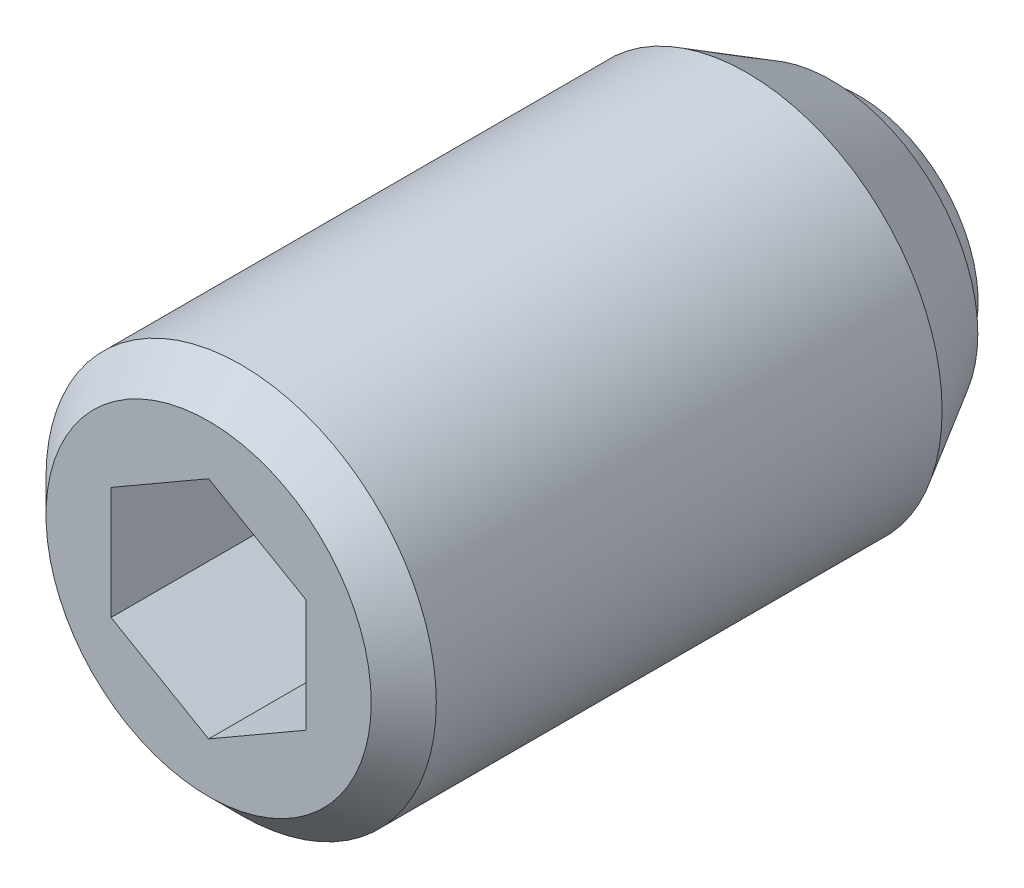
ISO-10303-21;
HEADER;
FILE_DESCRIPTION(('STEP AP214'),'2;1');
FILE_NAME('part.step','',(''),(''),'','','');
FILE_SCHEMA(('AUTOMOTIVE_DESIGN { 1 0 10303 214 1 1 1 1 }'));
ENDSEC;
DATA;
#1=APPLICATION_CONTEXT('core data for automotive mechanical design processes');
#2=APPLICATION_PROTOCOL_DEFINITION('international standard','automotive_design',2000,#1);
#3=PRODUCT_CONTEXT('',#1,'mechanical');
#4=PRODUCT('Part','Part','',(#3));
#5=PRODUCT_RELATED_PRODUCT_CATEGORY('part','',(#4));
#6=PRODUCT_DEFINITION_FORMATION('','',#4);
#7=PRODUCT_DEFINITION_CONTEXT('part definition',#1,'design');
#8=PRODUCT_DEFINITION('design','',#6,#7);
#9=PRODUCT_DEFINITION_SHAPE('','',#8);
#10=(LENGTH_UNIT() NAMED_UNIT(*) SI_UNIT(.MILLI.,.METRE.));
#11=(NAMED_UNIT(*) PLANE_ANGLE_UNIT() SI_UNIT($,.RADIAN.));
#12=(NAMED_UNIT(*) SI_UNIT($,.STERADIAN.) SOLID_ANGLE_UNIT());
#13=UNCERTAINTY_MEASURE_WITH_UNIT(LENGTH_MEASURE(1.E-05),#10,'distance_accuracy_value','');
#14=(GEOMETRIC_REPRESENTATION_CONTEXT(3) GLOBAL_UNCERTAINTY_ASSIGNED_CONTEXT((#13)) GLOBAL_UNIT_ASSIGNED_CONTEXT((#10,
#11,#12)) REPRESENTATION_CONTEXT('',''));
#15=CARTESIAN_POINT('',(0.,0.,0.));
#16=DIRECTION('',(0.,0.,1.));
#17=DIRECTION('',(1.,0.,0.));
#18=AXIS2_PLACEMENT_3D('',#15,#16,#17);
#19=CARTESIAN_POINT('',(3.,1.73205080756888,17.5));
#20=DIRECTION('',(0.5,0.86602540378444,0.));
#21=DIRECTION('',(0.86602540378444,-0.5,0.));
#22=AXIS2_PLACEMENT_3D('',#19,#20,#21);
#23=PLANE('',#22);
#24=DIRECTION('',(0.,0.,1.));
#25=VECTOR('',#24,1.);
#26=CARTESIAN_POINT('',(3.,1.73205080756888,17.5));
#27=LINE('',#26,#25);
#28=CARTESIAN_POINT('',(3.,1.73205080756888,15.));
#29=VERTEX_POINT('',#28);
#30=CARTESIAN_POINT('',(3.,1.73205080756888,20.));
#31=VERTEX_POINT('',#30);
#32=EDGE_CURVE('E68',#29,#31,#27,.T.);
#33=ORIENTED_EDGE('',*,*,#32,.T.);
#34=DIRECTION('',(-0.86602540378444,0.5,0.));
#35=VECTOR('',#34,1.);
#36=CARTESIAN_POINT('',(3.,1.73205080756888,20.));
#37=LINE('',#36,#35);
#38=CARTESIAN_POINT('',(0.,3.46410161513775,20.));
#39=VERTEX_POINT('',#38);
#40=EDGE_CURVE('E29',#31,#39,#37,.T.);
#41=ORIENTED_EDGE('',*,*,#40,.T.);
#42=DIRECTION('',(0.,0.,1.));
#43=VECTOR('',#42,1.);
#44=CARTESIAN_POINT('',(0.,3.46410161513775,17.5));
#45=LINE('',#44,#43);
#46=CARTESIAN_POINT('',(0.,3.46410161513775,15.));
#47=VERTEX_POINT('',#46);
#48=EDGE_CURVE('E80',#47,#39,#45,.T.);
#49=ORIENTED_EDGE('',*,*,#48,.F.);
#50=DIRECTION('',(-0.86602540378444,0.5,0.));
#51=VECTOR('',#50,1.);
#52=CARTESIAN_POINT('',(3.,1.73205080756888,15.));
#53=LINE('',#52,#51);
#54=EDGE_CURVE('E79',#29,#47,#53,.T.);
#55=ORIENTED_EDGE('',*,*,#54,.F.);
#56=EDGE_LOOP('',(#33,#41,#49,#55));
#57=FACE_BOUND('',#56,.T.);
#58=ADVANCED_FACE('F14',(#57),#23,.F.);
#59=CARTESIAN_POINT('',(3.,-1.73205080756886,17.5));
#60=DIRECTION('',(1.,0.,0.));
#61=DIRECTION('',(0.,-1.,0.));
#62=AXIS2_PLACEMENT_3D('',#59,#60,#61);
#63=PLANE('',#62);
#64=DIRECTION('',(0.,0.,1.));
#65=VECTOR('',#64,1.);
#66=CARTESIAN_POINT('',(3.,-1.73205080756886,17.5));
#67=LINE('',#66,#65);
#68=CARTESIAN_POINT('',(3.,-1.73205080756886,15.));
#69=VERTEX_POINT('',#68);
#70=CARTESIAN_POINT('',(3.,-1.73205080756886,20.));
#71=VERTEX_POINT('',#70);
#72=EDGE_CURVE('E76',#69,#71,#67,.T.);
#73=ORIENTED_EDGE('',*,*,#72,.T.);
#74=DIRECTION('',(0.,1.,0.));
#75=VECTOR('',#74,1.);
#76=CARTESIAN_POINT('',(3.,-1.73205080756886,20.));
#77=LINE('',#76,#75);
#78=EDGE_CURVE('E75',#71,#31,#77,.T.);
#79=ORIENTED_EDGE('',*,*,#78,.T.);
#80=ORIENTED_EDGE('',*,*,#32,.F.);
#81=DIRECTION('',(0.,1.,0.));
#82=VECTOR('',#81,1.);
#83=CARTESIAN_POINT('',(3.,-1.73205080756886,15.));
#84=LINE('',#83,#82);
#85=EDGE_CURVE('E72',#69,#29,#84,.T.);
#86=ORIENTED_EDGE('',*,*,#85,.F.);
#87=EDGE_LOOP('',(#73,#79,#80,#86));
#88=FACE_BOUND('',#87,.T.);
#89=ADVANCED_FACE('F70',(#88),#63,.F.);
#90=CARTESIAN_POINT('',(3.,-1.73205080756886,17.5));
#91=DIRECTION('',(-0.5,0.866025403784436,0.));
#92=DIRECTION('',(0.866025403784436,0.5,0.));
#93=AXIS2_PLACEMENT_3D('',#90,#91,#92);
#94=PLANE('',#93);
#95=DIRECTION('',(0.,0.,1.));
#96=VECTOR('',#95,1.);
#97=CARTESIAN_POINT('',(0.,-3.46410161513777,17.5));
#98=LINE('',#97,#96);
#99=CARTESIAN_POINT('',(0.,-3.46410161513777,15.));
#100=VERTEX_POINT('',#99);
#101=CARTESIAN_POINT('',(0.,-3.46410161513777,20.));
#102=VERTEX_POINT('',#101);
#103=EDGE_CURVE('E122',#100,#102,#98,.T.);
#104=ORIENTED_EDGE('',*,*,#103,.T.);
#105=DIRECTION('',(-0.866025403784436,-0.5,0.));
#106=VECTOR('',#105,1.);
#107=CARTESIAN_POINT('',(3.,-1.73205080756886,20.));
#108=LINE('',#107,#106);
#109=EDGE_CURVE('E113',#71,#102,#108,.T.);
#110=ORIENTED_EDGE('',*,*,#109,.F.);
#111=ORIENTED_EDGE('',*,*,#72,.F.);
#112=DIRECTION('',(0.866025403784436,0.5,0.));
#113=VECTOR('',#112,1.);
#114=CARTESIAN_POINT('',(0.,-3.46410161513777,15.));
#115=LINE('',#114,#113);
#116=EDGE_CURVE('E89',#100,#69,#115,.T.);
#117=ORIENTED_EDGE('',*,*,#116,.F.);
#118=EDGE_LOOP('',(#104,#110,#111,#117));
#119=FACE_BOUND('',#118,.T.);
#120=ADVANCED_FACE('F147',(#119),#94,.T.);
#121=CARTESIAN_POINT('',(-3.,-1.73205080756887,17.5));
#122=DIRECTION('',(-0.5,-0.866025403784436,0.));
#123=DIRECTION('',(-0.866025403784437,0.5,0.));
#124=AXIS2_PLACEMENT_3D('',#121,#122,#123);
#125=PLANE('',#124);
#126=DIRECTION('',(0.,0.,1.));
#127=VECTOR('',#126,1.);
#128=CARTESIAN_POINT('',(-3.,-1.73205080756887,17.5));
#129=LINE('',#128,#127);
#130=CARTESIAN_POINT('',(-3.,-1.73205080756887,15.));
#131=VERTEX_POINT('',#130);
#132=CARTESIAN_POINT('',(-3.,-1.73205080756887,20.));
#133=VERTEX_POINT('',#132);
#134=EDGE_CURVE('E120',#131,#133,#129,.T.);
#135=ORIENTED_EDGE('',*,*,#134,.T.);
#136=DIRECTION('',(0.866025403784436,-0.5,0.));
#137=VECTOR('',#136,1.);
#138=CARTESIAN_POINT('',(-3.,-1.73205080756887,20.));
#139=LINE('',#138,#137);
#140=EDGE_CURVE('E111',#133,#102,#139,.T.);
#141=ORIENTED_EDGE('',*,*,#140,.T.);
#142=ORIENTED_EDGE('',*,*,#103,.F.);
#143=DIRECTION('',(0.866025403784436,-0.5,0.));
#144=VECTOR('',#143,1.);
#145=CARTESIAN_POINT('',(-3.,-1.73205080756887,15.));
#146=LINE('',#145,#144);
#147=EDGE_CURVE('E101',#131,#100,#146,.T.);
#148=ORIENTED_EDGE('',*,*,#147,.F.);
#149=EDGE_LOOP('',(#135,#141,#142,#148));
#150=FACE_BOUND('',#149,.T.);
#151=ADVANCED_FACE('F157',(#150),#125,.F.);
#152=CARTESIAN_POINT('',(-3.,-1.73205080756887,17.5));
#153=DIRECTION('',(1.,0.,0.));
#154=DIRECTION('',(0.,-1.,0.));
#155=AXIS2_PLACEMENT_3D('',#152,#153,#154);
#156=PLANE('',#155);
#157=DIRECTION('',(0.,0.,1.));
#158=VECTOR('',#157,1.);
#159=CARTESIAN_POINT('',(-3.,1.73205080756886,17.5));
#160=LINE('',#159,#158);
#161=CARTESIAN_POINT('',(-3.,1.73205080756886,15.));
#162=VERTEX_POINT('',#161);
#163=CARTESIAN_POINT('',(-3.,1.73205080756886,20.));
#164=VERTEX_POINT('',#163);
#165=EDGE_CURVE('E37',#162,#164,#160,.T.);
#166=ORIENTED_EDGE('',*,*,#165,.T.);
#167=DIRECTION('',(0.,1.,0.));
#168=VECTOR('',#167,1.);
#169=CARTESIAN_POINT('',(-3.,-1.73205080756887,20.));
#170=LINE('',#169,#168);
#171=EDGE_CURVE('E108',#133,#164,#170,.T.);
#172=ORIENTED_EDGE('',*,*,#171,.F.);
#173=ORIENTED_EDGE('',*,*,#134,.F.);
#174=DIRECTION('',(0.,-1.,0.));
#175=VECTOR('',#174,1.);
#176=CARTESIAN_POINT('',(-3.,1.73205080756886,15.));
#177=LINE('',#176,#175);
#178=EDGE_CURVE('E98',#162,#131,#177,.T.);
#179=ORIENTED_EDGE('',*,*,#178,.F.);
#180=EDGE_LOOP('',(#166,#172,#173,#179));
#181=FACE_BOUND('',#180,.T.);
#182=ADVANCED_FACE('F153',(#181),#156,.T.);
#183=CARTESIAN_POINT('',(-3.,1.73205080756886,17.5));
#184=DIRECTION('',(0.5,-0.866025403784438,0.));
#185=DIRECTION('',(-0.866025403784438,-0.5,0.));
#186=AXIS2_PLACEMENT_3D('',#183,#184,#185);
#187=PLANE('',#186);
#188=ORIENTED_EDGE('',*,*,#165,.F.);
#189=DIRECTION('',(-0.866025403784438,-0.5,0.));
#190=VECTOR('',#189,1.);
#191=CARTESIAN_POINT('',(0.,3.46410161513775,15.));
#192=LINE('',#191,#190);
#193=EDGE_CURVE('E84',#47,#162,#192,.T.);
#194=ORIENTED_EDGE('',*,*,#193,.F.);
#195=ORIENTED_EDGE('',*,*,#48,.T.);
#196=DIRECTION('',(0.866025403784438,0.5,0.));
#197=VECTOR('',#196,1.);
#198=CARTESIAN_POINT('',(-3.,1.73205080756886,20.));
#199=LINE('',#198,#197);
#200=EDGE_CURVE('E105',#164,#39,#199,.T.);
#201=ORIENTED_EDGE('',*,*,#200,.F.);
#202=EDGE_LOOP('',(#188,#194,#195,#201));
#203=FACE_BOUND('',#202,.T.);
#204=ADVANCED_FACE('F150',(#203),#187,.T.);
#205=CARTESIAN_POINT('',(0.,0.,19.75));
#206=DIRECTION('',(0.,0.,-1.));
#207=DIRECTION('',(1.,0.,0.));
#208=AXIS2_PLACEMENT_3D('',#205,#206,#207);
#209=CYLINDRICAL_SURFACE('',#208,6.);
#210=CARTESIAN_POINT('',(0.,0.,19.));
#211=DIRECTION('',(0.,0.,-1.));
#212=DIRECTION('',(1.,0.,0.));
#213=AXIS2_PLACEMENT_3D('',#210,#211,#212);
#214=CIRCLE('',#213,6.);
#215=CARTESIAN_POINT('',(6.,0.,19.));
#216=VERTEX_POINT('',#215);
#217=EDGE_CURVE('E9',#216,#216,#214,.T.);
#218=ORIENTED_EDGE('',*,*,#217,.T.);
#219=EDGE_LOOP('',(#218));
#220=FACE_BOUND('',#219,.T.);
#221=CARTESIAN_POINT('',(0.,0.,3.4480762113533));
#222=DIRECTION('',(0.,0.,-1.));
#223=DIRECTION('',(-1.,0.,0.));
#224=AXIS2_PLACEMENT_3D('',#221,#222,#223);
#225=CIRCLE('',#224,6.);
#226=CARTESIAN_POINT('',(-6.,0.,3.4480762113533));
#227=VERTEX_POINT('',#226);
#228=EDGE_CURVE('E260',#227,#227,#225,.T.);
#229=ORIENTED_EDGE('',*,*,#228,.F.);
#230=EDGE_LOOP('',(#229));
#231=FACE_BOUND('',#230,.T.);
#232=ADVANCED_FACE('F16',(#220,#231),#209,.T.);
#233=CARTESIAN_POINT('',(0.,0.,19.));
#234=DIRECTION('',(0.,0.,-1.));
#235=DIRECTION('',(1.,0.,0.));
#236=AXIS2_PLACEMENT_3D('',#233,#234,#235);
#237=CONICAL_SURFACE('',#236,6.,0.785398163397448);
#238=CARTESIAN_POINT('',(0.,0.,20.));
#239=DIRECTION('',(0.,0.,-1.));
#240=DIRECTION('',(1.,0.,0.));
#241=AXIS2_PLACEMENT_3D('',#238,#239,#240);
#242=CIRCLE('',#241,5.);
#243=CARTESIAN_POINT('',(5.,0.,20.));
#244=VERTEX_POINT('',#243);
#245=EDGE_CURVE('E22',#244,#244,#242,.T.);
#246=ORIENTED_EDGE('',*,*,#245,.T.);
#247=EDGE_LOOP('',(#246));
#248=FACE_BOUND('',#247,.T.);
#249=ORIENTED_EDGE('',*,*,#217,.F.);
#250=EDGE_LOOP('',(#249));
#251=FACE_BOUND('',#250,.T.);
#252=ADVANCED_FACE('F127',(#248,#251),#237,.T.);
#253=CARTESIAN_POINT('',(0.,0.,20.));
#254=DIRECTION('',(0.,0.,-1.));
#255=DIRECTION('',(1.,0.,0.));
#256=AXIS2_PLACEMENT_3D('',#253,#254,#255);
#257=PLANE('',#256);
#258=ORIENTED_EDGE('',*,*,#200,.T.);
#259=ORIENTED_EDGE('',*,*,#40,.F.);
#260=ORIENTED_EDGE('',*,*,#78,.F.);
#261=ORIENTED_EDGE('',*,*,#109,.T.);
#262=ORIENTED_EDGE('',*,*,#140,.F.);
#263=ORIENTED_EDGE('',*,*,#171,.T.);
#264=EDGE_LOOP('',(#258,#259,#260,#261,#262,#263));
#265=FACE_BOUND('',#264,.T.);
#266=ORIENTED_EDGE('',*,*,#245,.F.);
#267=EDGE_LOOP('',(#266));
#268=FACE_BOUND('',#267,.T.);
#269=ADVANCED_FACE('F130',(#265,#268),#257,.F.);
#270=CARTESIAN_POINT('',(3.,1.73205080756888,15.));
#271=DIRECTION('',(0.,0.,1.));
#272=DIRECTION('',(1.,0.,0.));
#273=AXIS2_PLACEMENT_3D('',#270,#271,#272);
#274=PLANE('',#273);
#275=ORIENTED_EDGE('',*,*,#85,.T.);
#276=ORIENTED_EDGE('',*,*,#54,.T.);
#277=ORIENTED_EDGE('',*,*,#193,.T.);
#278=ORIENTED_EDGE('',*,*,#178,.T.);
#279=ORIENTED_EDGE('',*,*,#147,.T.);
#280=ORIENTED_EDGE('',*,*,#116,.T.);
#281=EDGE_LOOP('',(#275,#276,#277,#278,#279,#280));
#282=FACE_BOUND('',#281,.T.);
#283=ADVANCED_FACE('F86',(#282),#274,.T.);
#284=CARTESIAN_POINT('',(0.,0.,0.));
#285=DIRECTION('',(0.,0.,-1.));
#286=DIRECTION('',(-1.,0.,0.));
#287=AXIS2_PLACEMENT_3D('',#284,#285,#286);
#288=PLANE('',#287);
#289=CARTESIAN_POINT('',(0.,0.,0.));
#290=DIRECTION('',(0.,0.,-1.));
#291=DIRECTION('',(-1.,0.,0.));
#292=AXIS2_PLACEMENT_3D('',#289,#290,#291);
#293=CIRCLE('',#292,3.66060104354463);
#294=CARTESIAN_POINT('',(-3.66060104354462,0.,0.));
#295=VERTEX_POINT('',#294);
#296=EDGE_CURVE('E90',#295,#295,#293,.T.);
#297=ORIENTED_EDGE('',*,*,#296,.T.);
#298=EDGE_LOOP('',(#297));
#299=FACE_BOUND('',#298,.T.);
#300=ADVANCED_FACE('F139',(#299),#288,.T.);
#301=CARTESIAN_POINT('',(0.,0.,2.35));
#302=DIRECTION('',(0.,0.,-1.));
#303=DIRECTION('',(-1.,0.,0.));
#304=AXIS2_PLACEMENT_3D('',#301,#302,#303);
#305=SPHERICAL_SURFACE('',#304,4.35);
#306=CARTESIAN_POINT('',(0.,0.,0.85));
#307=DIRECTION('',(0.,0.,-1.));
#308=DIRECTION('',(-1.,0.,0.));
#309=AXIS2_PLACEMENT_3D('',#306,#307,#308);
#310=CIRCLE('',#309,4.08319727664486);
#311=CARTESIAN_POINT('',(-4.08319727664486,0.,0.85));
#312=VERTEX_POINT('',#311);
#313=EDGE_CURVE('E93',#312,#312,#310,.T.);
#314=CARTESIAN_POINT('',(-4.08319727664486,0.,0.85));
#315=CARTESIAN_POINT('',(-4.07978079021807,0.,0.840699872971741));
#316=CARTESIAN_POINT('',(-4.07633252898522,0.,0.831411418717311));
#317=CARTESIAN_POINT('',(-4.06937262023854,0.,0.812858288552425));
#318=CARTESIAN_POINT('',(-4.06586097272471,0.,0.803593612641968));
#319=CARTESIAN_POINT('',(-4.0587744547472,0.,0.785088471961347));
#320=CARTESIAN_POINT('',(-4.05519958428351,0.,0.775848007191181));
#321=CARTESIAN_POINT('',(-4.04798678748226,0.,0.757391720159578));
#322=CARTESIAN_POINT('',(-4.04434886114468,0.,0.74817589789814));
#323=CARTESIAN_POINT('',(-4.03701012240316,0.,0.729769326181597));
#324=CARTESIAN_POINT('',(-4.03330930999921,0.,0.720578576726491));
#325=CARTESIAN_POINT('',(-4.0258449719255,0.,0.702222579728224));
#326=CARTESIAN_POINT('',(-4.02208144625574,0.,0.693057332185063));
#327=CARTESIAN_POINT('',(-4.01449185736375,0.,0.674752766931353));
#328=CARTESIAN_POINT('',(-4.01066579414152,0.,0.665613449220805));
#329=CARTESIAN_POINT('',(-4.00295130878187,0.,0.647361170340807));
#330=CARTESIAN_POINT('',(-3.99906288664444,0.,0.638248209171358));
#331=CARTESIAN_POINT('',(-3.99122386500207,0.,0.620049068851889));
#332=CARTESIAN_POINT('',(-3.98727326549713,0.,0.610962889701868));
#333=CARTESIAN_POINT('',(-3.9793100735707,0.,0.592817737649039));
#334=CARTESIAN_POINT('',(-3.97529748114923,0.,0.58375876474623));
#335=CARTESIAN_POINT('',(-3.96721049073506,0.,0.565668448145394));
#336=CARTESIAN_POINT('',(-3.96313609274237,0.,0.556637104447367));
#337=CARTESIAN_POINT('',(-3.95492568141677,0.,0.538602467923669));
#338=CARTESIAN_POINT('',(-3.95078966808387,0.,0.529599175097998));
#339=CARTESIAN_POINT('',(-3.94245621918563,0.,0.51162106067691));
#340=CARTESIAN_POINT('',(-3.93825878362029,0.,0.502646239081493));
#341=CARTESIAN_POINT('',(-3.92980268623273,0.,0.484725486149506));
#342=CARTESIAN_POINT('',(-3.9255440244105,0.,0.475779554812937));
#343=CARTESIAN_POINT('',(-3.9169656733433,0.,0.457917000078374));
#344=CARTESIAN_POINT('',(-3.91264598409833,0.,0.449000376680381));
#345=CARTESIAN_POINT('',(-3.90394577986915,0.,0.431196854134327));
#346=CARTESIAN_POINT('',(-3.89956526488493,0.,0.422309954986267));
#347=CARTESIAN_POINT('',(-3.89074361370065,0.,0.404566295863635));
#348=CARTESIAN_POINT('',(-3.88630247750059,0.,0.395709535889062));
#349=CARTESIAN_POINT('',(-3.87735979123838,0.,0.378026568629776));
#350=CARTESIAN_POINT('',(-3.87285824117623,0.,0.369200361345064));
#351=CARTESIAN_POINT('',(-3.8637949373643,0.,0.351578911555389));
#352=CARTESIAN_POINT('',(-3.85923318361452,0.,0.342783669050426));
#353=CARTESIAN_POINT('',(-3.85004968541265,0.,0.325224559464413));
#354=CARTESIAN_POINT('',(-3.84542794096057,0.,0.316460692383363));
#355=CARTESIAN_POINT('',(-3.83612467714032,0.,0.298964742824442));
#356=CARTESIAN_POINT('',(-3.83144315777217,0.,0.290232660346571));
#357=CARTESIAN_POINT('',(-3.82202056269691,0.,0.272800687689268));
#358=CARTESIAN_POINT('',(-3.8172794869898,0.,0.264100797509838));
#359=CARTESIAN_POINT('',(-3.80773800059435,0.,0.246733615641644));
#360=CARTESIAN_POINT('',(-3.80293758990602,0.,0.238066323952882));
#361=CARTESIAN_POINT('',(-3.79327765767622,0.,0.220764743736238));
#362=CARTESIAN_POINT('',(-3.78841813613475,0.,0.212130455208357));
#363=CARTESIAN_POINT('',(-3.77864020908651,0.,0.194895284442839));
#364=CARTESIAN_POINT('',(-3.77372180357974,0.,0.186294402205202));
#365=CARTESIAN_POINT('',(-3.76382633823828,0.,0.169126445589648));
#366=CARTESIAN_POINT('',(-3.75884927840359,0.,0.160559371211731));
#367=CARTESIAN_POINT('',(-3.7488367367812,0.,0.143459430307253));
#368=CARTESIAN_POINT('',(-3.7438012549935,0.,0.134926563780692));
#369=CARTESIAN_POINT('',(-3.73367210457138,0.,0.117895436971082));
#370=CARTESIAN_POINT('',(-3.72857843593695,0.,0.109397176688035));
#371=CARTESIAN_POINT('',(-3.7183331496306,0.,0.0924356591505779));
#372=CARTESIAN_POINT('',(-3.71318153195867,0.,0.0839724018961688));
#373=CARTESIAN_POINT('',(-3.70282058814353,0.,0.0670812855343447));
#374=CARTESIAN_POINT('',(-3.69761126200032,0.,0.0586534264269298));
#375=CARTESIAN_POINT('',(-3.6871351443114,0.,0.0418334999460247));
#376=CARTESIAN_POINT('',(-3.68186835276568,0.,0.0334414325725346));
#377=CARTESIAN_POINT('',(-3.67127755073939,0.,0.0166934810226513));
#378=CARTESIAN_POINT('',(-3.66595354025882,0.,0.00833759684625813));
#379=CARTESIAN_POINT('',(-3.66060104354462,0.,0.));
#380=B_SPLINE_CURVE_WITH_KNOTS('',3,(#314,#315,#316,#317,#318,#319,#320,#321,#322,#323,#324,
#325,#326,#327,#328,#329,#330,#331,#332,#333,#334,#335,#336,#337,#338,#339,#340,#341,#342,#343,
#344,#345,#346,#347,#348,#349,#350,#351,#352,#353,#354,#355,#356,#357,#358,#359,#360,#361,#362,
#363,#364,#365,#366,#367,#368,#369,#370,#371,#372,#373,#374,#375,#376,#377,#378,#379),
.UNSPECIFIED.,.F.,.F.,(4,2,2,2,2,2,2,2,2,2,2,2,2,2,2,2,2,2,2,2,2,2,2,2,2,2,2,2,2,2,2,2,4),(0.,
0.0297233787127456,0.0594467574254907,0.0891701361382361,0.118893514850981,0.148616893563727,
0.178340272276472,0.208063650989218,0.237787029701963,0.267510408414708,0.297233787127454,
0.326957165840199,0.356680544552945,0.38640392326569,0.416127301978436,0.445850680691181,
0.475574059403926,0.505297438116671,0.535020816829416,0.564744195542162,0.594467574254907,
0.624190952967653,0.653914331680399,0.683637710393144,0.713361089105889,0.743084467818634,
0.77280784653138,0.802531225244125,0.832254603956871,0.861977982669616,0.891701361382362,
0.921424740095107,0.951148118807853),.UNSPECIFIED.);
#381=EDGE_CURVE('BSEAM223',#312,#295,#380,.T.);
#382=ORIENTED_EDGE('',*,*,#313,.T.);
#383=ORIENTED_EDGE('',*,*,#296,.F.);
#384=ORIENTED_EDGE('',*,*,#381,.T.);
#385=ORIENTED_EDGE('',*,*,#381,.F.);
#386=EDGE_LOOP('',(#382,#384,#383,#385));
#387=FACE_BOUND('',#386,.T.);
#388=ADVANCED_FACE('F223',(#387),#305,.T.);
#389=CARTESIAN_POINT('',(-4.08319727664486,0.,0.85));
#390=DIRECTION('',(0.,0.,-1.));
#391=DIRECTION('',(-1.,0.,0.));
#392=AXIS2_PLACEMENT_3D('',#389,#390,#391);
#393=PLANE('',#392);
#394=CARTESIAN_POINT('',(0.,0.,0.85));
#395=DIRECTION('',(0.,0.,-1.));
#396=DIRECTION('',(-1.,0.,0.));
#397=AXIS2_PLACEMENT_3D('',#394,#395,#396);
#398=CIRCLE('',#397,4.5);
#399=CARTESIAN_POINT('',(-4.5,0.,0.85));
#400=VERTEX_POINT('',#399);
#401=EDGE_CURVE('E263',#400,#400,#398,.T.);
#402=ORIENTED_EDGE('',*,*,#401,.T.);
#403=EDGE_LOOP('',(#402));
#404=FACE_BOUND('',#403,.T.);
#405=ORIENTED_EDGE('',*,*,#313,.F.);
#406=EDGE_LOOP('',(#405));
#407=FACE_BOUND('',#406,.T.);
#408=ADVANCED_FACE('F232',(#404,#407),#393,.T.);
#409=CARTESIAN_POINT('',(0.,0.,0.85));
#410=DIRECTION('',(0.,0.,1.));
#411=DIRECTION('',(1.,0.,0.));
#412=AXIS2_PLACEMENT_3D('',#409,#410,#411);
#413=CONICAL_SURFACE('',#412,4.5,0.523598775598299);
#414=ORIENTED_EDGE('',*,*,#228,.T.);
#415=EDGE_LOOP('',(#414));
#416=FACE_BOUND('',#415,.T.);
#417=ORIENTED_EDGE('',*,*,#401,.F.);
#418=EDGE_LOOP('',(#417));
#419=FACE_BOUND('',#418,.T.);
#420=ADVANCED_FACE('F242',(#416,#419),#413,.T.);
#421=CLOSED_SHELL('',(#58,#89,#120,#151,#182,#204,#232,#252,#269,#283,#300,#388,#408,#420));
#422=MANIFOLD_SOLID_BREP('B1',#421);
#423=ADVANCED_BREP_SHAPE_REPRESENTATION('',(#18,#422),#14);
#424=SHAPE_DEFINITION_REPRESENTATION(#9,#423);
ENDSEC;
END-ISO-10303-21;
